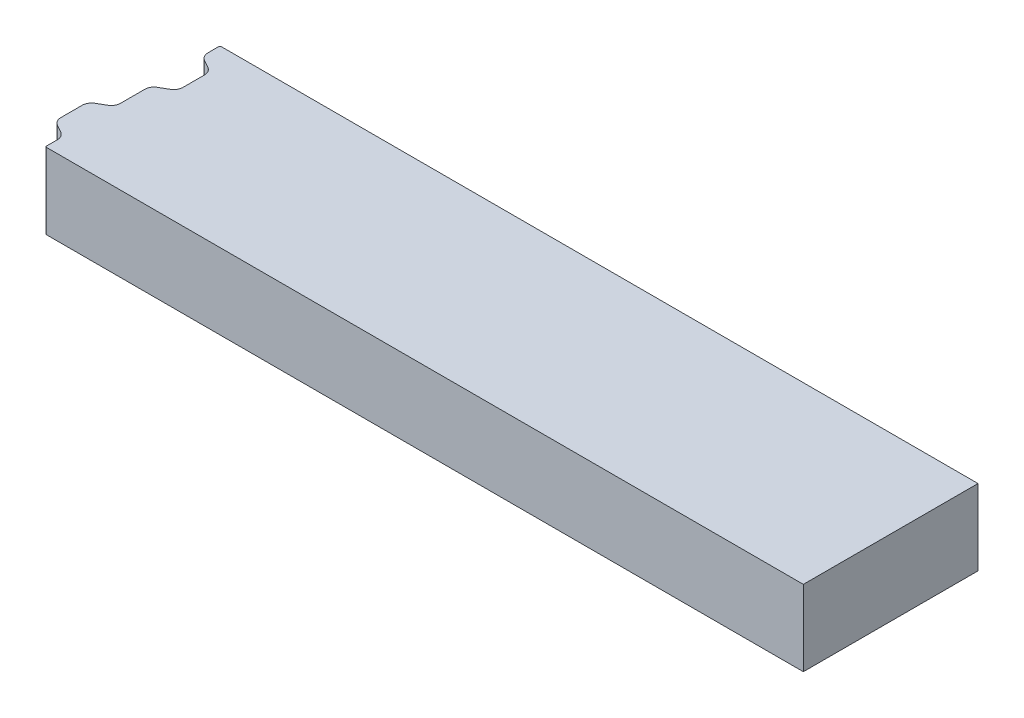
ISO-10303-21;
HEADER;
FILE_DESCRIPTION(('STEP AP214'),'2;1');
FILE_NAME('part.step','',(''),(''),'','','');
FILE_SCHEMA(('AUTOMOTIVE_DESIGN { 1 0 10303 214 1 1 1 1 }'));
ENDSEC;
DATA;
#1=APPLICATION_CONTEXT('core data for automotive mechanical design processes');
#2=APPLICATION_PROTOCOL_DEFINITION('international standard','automotive_design',2000,#1);
#3=PRODUCT_CONTEXT('',#1,'mechanical');
#4=PRODUCT('Part','Part','',(#3));
#5=PRODUCT_RELATED_PRODUCT_CATEGORY('part','',(#4));
#6=PRODUCT_DEFINITION_FORMATION('','',#4);
#7=PRODUCT_DEFINITION_CONTEXT('part definition',#1,'design');
#8=PRODUCT_DEFINITION('design','',#6,#7);
#9=PRODUCT_DEFINITION_SHAPE('','',#8);
#10=(LENGTH_UNIT() NAMED_UNIT(*) SI_UNIT(.MILLI.,.METRE.));
#11=(NAMED_UNIT(*) PLANE_ANGLE_UNIT() SI_UNIT($,.RADIAN.));
#12=(NAMED_UNIT(*) SI_UNIT($,.STERADIAN.) SOLID_ANGLE_UNIT());
#13=UNCERTAINTY_MEASURE_WITH_UNIT(LENGTH_MEASURE(1.E-05),#10,'distance_accuracy_value','');
#14=(GEOMETRIC_REPRESENTATION_CONTEXT(3) GLOBAL_UNCERTAINTY_ASSIGNED_CONTEXT((#13)) GLOBAL_UNIT_ASSIGNED_CONTEXT((#10,
#11,#12)) REPRESENTATION_CONTEXT('',''));
#15=CARTESIAN_POINT('',(0.,0.,0.));
#16=DIRECTION('',(0.,0.,1.));
#17=DIRECTION('',(1.,0.,0.));
#18=AXIS2_PLACEMENT_3D('',#15,#16,#17);
#19=CARTESIAN_POINT('',(-1.59999999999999,13.,-2.07623956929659));
#20=DIRECTION('',(0.,-1.,0.));
#21=DIRECTION('',(0.,0.,-1.));
#22=AXIS2_PLACEMENT_3D('',#19,#20,#21);
#23=CYLINDRICAL_SURFACE('',#22,1.59999999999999);
#24=CARTESIAN_POINT('',(-1.59999999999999,0.,-2.07623956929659));
#25=DIRECTION('',(0.,-1.,0.));
#26=DIRECTION('',(0.,0.,1.));
#27=AXIS2_PLACEMENT_3D('',#24,#25,#26);
#28=CIRCLE('',#27,1.59999999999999);
#29=CARTESIAN_POINT('',(-0.800000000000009,0.,-3.4618802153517));
#30=VERTEX_POINT('',#29);
#31=CARTESIAN_POINT('',(0.,0.,-2.07623956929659));
#32=VERTEX_POINT('',#31);
#33=EDGE_CURVE('E178',#30,#32,#28,.T.);
#34=ORIENTED_EDGE('',*,*,#33,.T.);
#35=DIRECTION('',(0.,-1.,0.));
#36=VECTOR('',#35,1.);
#37=CARTESIAN_POINT('',(0.,13.,-2.07623956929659));
#38=LINE('',#37,#36);
#39=CARTESIAN_POINT('',(0.,13.,-2.07623956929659));
#40=VERTEX_POINT('',#39);
#41=EDGE_CURVE('E11',#40,#32,#38,.T.);
#42=ORIENTED_EDGE('',*,*,#41,.F.);
#43=CARTESIAN_POINT('',(-1.59999999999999,13.,-2.07623956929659));
#44=DIRECTION('',(0.,-1.,0.));
#45=DIRECTION('',(0.,0.,1.));
#46=AXIS2_PLACEMENT_3D('',#43,#44,#45);
#47=CIRCLE('',#46,1.59999999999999);
#48=CARTESIAN_POINT('',(-0.800000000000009,13.,-3.4618802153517));
#49=VERTEX_POINT('',#48);
#50=EDGE_CURVE('E233',#49,#40,#47,.T.);
#51=ORIENTED_EDGE('',*,*,#50,.F.);
#52=DIRECTION('',(0.,-1.,0.));
#53=VECTOR('',#52,1.);
#54=CARTESIAN_POINT('',(-0.800000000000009,13.,-3.4618802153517));
#55=LINE('',#54,#53);
#56=EDGE_CURVE('E191',#49,#30,#55,.T.);
#57=ORIENTED_EDGE('',*,*,#56,.T.);
#58=EDGE_LOOP('',(#34,#42,#51,#57));
#59=FACE_BOUND('',#58,.T.);
#60=ADVANCED_FACE('F26',(#59),#23,.F.);
#61=CARTESIAN_POINT('',(0.,13.,-0.200000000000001));
#62=DIRECTION('',(1.,0.,0.));
#63=DIRECTION('',(0.,0.,-1.));
#64=AXIS2_PLACEMENT_3D('',#61,#62,#63);
#65=PLANE('',#64);
#66=DIRECTION('',(0.,0.,1.));
#67=VECTOR('',#66,1.);
#68=CARTESIAN_POINT('',(0.,0.,-0.200000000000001));
#69=LINE('',#68,#67);
#70=CARTESIAN_POINT('',(0.,0.,-0.200000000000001));
#71=VERTEX_POINT('',#70);
#72=EDGE_CURVE('E174',#32,#71,#69,.T.);
#73=ORIENTED_EDGE('',*,*,#72,.T.);
#74=DIRECTION('',(0.,-1.,0.));
#75=VECTOR('',#74,1.);
#76=CARTESIAN_POINT('',(0.,13.,-0.200000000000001));
#77=LINE('',#76,#75);
#78=CARTESIAN_POINT('',(0.,13.,-0.200000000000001));
#79=VERTEX_POINT('',#78);
#80=EDGE_CURVE('E33',#79,#71,#77,.T.);
#81=ORIENTED_EDGE('',*,*,#80,.F.);
#82=DIRECTION('',(0.,0.,1.));
#83=VECTOR('',#82,1.);
#84=CARTESIAN_POINT('',(0.,13.,-0.200000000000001));
#85=LINE('',#84,#83);
#86=EDGE_CURVE('E187',#40,#79,#85,.T.);
#87=ORIENTED_EDGE('',*,*,#86,.F.);
#88=ORIENTED_EDGE('',*,*,#41,.T.);
#89=EDGE_LOOP('',(#73,#81,#87,#88));
#90=FACE_BOUND('',#89,.T.);
#91=ADVANCED_FACE('F186',(#90),#65,.F.);
#92=CARTESIAN_POINT('',(0.199999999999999,13.,-0.2));
#93=DIRECTION('',(0.,-1.,0.));
#94=DIRECTION('',(0.,0.,-1.));
#95=AXIS2_PLACEMENT_3D('',#92,#93,#94);
#96=CYLINDRICAL_SURFACE('',#95,0.200000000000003);
#97=CARTESIAN_POINT('',(0.199999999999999,0.,-0.2));
#98=DIRECTION('',(0.,1.,0.));
#99=DIRECTION('',(0.,0.,1.));
#100=AXIS2_PLACEMENT_3D('',#97,#98,#99);
#101=CIRCLE('',#100,0.200000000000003);
#102=CARTESIAN_POINT('',(0.199999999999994,0.,0.));
#103=VERTEX_POINT('',#102);
#104=EDGE_CURVE('E180',#71,#103,#101,.T.);
#105=ORIENTED_EDGE('',*,*,#104,.T.);
#106=DIRECTION('',(0.,-1.,0.));
#107=VECTOR('',#106,1.);
#108=CARTESIAN_POINT('',(0.199999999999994,13.,0.));
#109=LINE('',#108,#107);
#110=CARTESIAN_POINT('',(0.199999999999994,13.,0.));
#111=VERTEX_POINT('',#110);
#112=EDGE_CURVE('E329',#111,#103,#109,.T.);
#113=ORIENTED_EDGE('',*,*,#112,.F.);
#114=CARTESIAN_POINT('',(0.199999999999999,13.,-0.2));
#115=DIRECTION('',(0.,1.,0.));
#116=DIRECTION('',(0.,0.,1.));
#117=AXIS2_PLACEMENT_3D('',#114,#115,#116);
#118=CIRCLE('',#117,0.200000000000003);
#119=EDGE_CURVE('E236',#79,#111,#118,.T.);
#120=ORIENTED_EDGE('',*,*,#119,.F.);
#121=ORIENTED_EDGE('',*,*,#80,.T.);
#122=EDGE_LOOP('',(#105,#113,#120,#121));
#123=FACE_BOUND('',#122,.T.);
#124=ADVANCED_FACE('F333',(#123),#96,.T.);
#125=CARTESIAN_POINT('',(0.199999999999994,13.,0.));
#126=DIRECTION('',(0.,0.,-1.));
#127=DIRECTION('',(-1.,0.,0.));
#128=AXIS2_PLACEMENT_3D('',#125,#126,#127);
#129=PLANE('',#128);
#130=DIRECTION('',(1.,0.,0.));
#131=VECTOR('',#130,1.);
#132=CARTESIAN_POINT('',(0.199999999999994,0.,0.));
#133=LINE('',#132,#131);
#134=CARTESIAN_POINT('',(130.2,0.,0.));
#135=VERTEX_POINT('',#134);
#136=EDGE_CURVE('E195',#103,#135,#133,.T.);
#137=ORIENTED_EDGE('',*,*,#136,.T.);
#138=DIRECTION('',(0.,-1.,0.));
#139=VECTOR('',#138,1.);
#140=CARTESIAN_POINT('',(130.2,13.,0.));
#141=LINE('',#140,#139);
#142=CARTESIAN_POINT('',(130.2,13.,0.));
#143=VERTEX_POINT('',#142);
#144=EDGE_CURVE('E326',#143,#135,#141,.T.);
#145=ORIENTED_EDGE('',*,*,#144,.F.);
#146=DIRECTION('',(1.,0.,0.));
#147=VECTOR('',#146,1.);
#148=CARTESIAN_POINT('',(0.199999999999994,13.,0.));
#149=LINE('',#148,#147);
#150=EDGE_CURVE('E238',#111,#143,#149,.T.);
#151=ORIENTED_EDGE('',*,*,#150,.F.);
#152=ORIENTED_EDGE('',*,*,#112,.T.);
#153=EDGE_LOOP('',(#137,#145,#151,#152));
#154=FACE_BOUND('',#153,.T.);
#155=ADVANCED_FACE('F341',(#154),#129,.F.);
#156=CARTESIAN_POINT('',(130.2,13.,-30.));
#157=DIRECTION('',(-1.,0.,0.));
#158=DIRECTION('',(0.,0.,1.));
#159=AXIS2_PLACEMENT_3D('',#156,#157,#158);
#160=PLANE('',#159);
#161=DIRECTION('',(0.,0.,-1.));
#162=VECTOR('',#161,1.);
#163=CARTESIAN_POINT('',(130.2,0.,-30.));
#164=LINE('',#163,#162);
#165=CARTESIAN_POINT('',(130.2,0.,-30.));
#166=VERTEX_POINT('',#165);
#167=EDGE_CURVE('E197',#135,#166,#164,.T.);
#168=ORIENTED_EDGE('',*,*,#167,.T.);
#169=DIRECTION('',(0.,-1.,0.));
#170=VECTOR('',#169,1.);
#171=CARTESIAN_POINT('',(130.2,13.,-30.));
#172=LINE('',#171,#170);
#173=CARTESIAN_POINT('',(130.2,13.,-30.));
#174=VERTEX_POINT('',#173);
#175=EDGE_CURVE('E323',#174,#166,#172,.T.);
#176=ORIENTED_EDGE('',*,*,#175,.F.);
#177=DIRECTION('',(0.,0.,-1.));
#178=VECTOR('',#177,1.);
#179=CARTESIAN_POINT('',(130.2,13.,-30.));
#180=LINE('',#179,#178);
#181=EDGE_CURVE('E240',#143,#174,#180,.T.);
#182=ORIENTED_EDGE('',*,*,#181,.F.);
#183=ORIENTED_EDGE('',*,*,#144,.T.);
#184=EDGE_LOOP('',(#168,#176,#182,#183));
#185=FACE_BOUND('',#184,.T.);
#186=ADVANCED_FACE('F344',(#185),#160,.F.);
#187=CARTESIAN_POINT('',(0.199999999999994,13.,-30.));
#188=DIRECTION('',(0.,0.,1.));
#189=DIRECTION('',(1.,0.,0.));
#190=AXIS2_PLACEMENT_3D('',#187,#188,#189);
#191=PLANE('',#190);
#192=DIRECTION('',(-1.,0.,0.));
#193=VECTOR('',#192,1.);
#194=CARTESIAN_POINT('',(0.199999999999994,0.,-30.));
#195=LINE('',#194,#193);
#196=CARTESIAN_POINT('',(0.199999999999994,0.,-30.));
#197=VERTEX_POINT('',#196);
#198=EDGE_CURVE('E199',#166,#197,#195,.T.);
#199=ORIENTED_EDGE('',*,*,#198,.T.);
#200=DIRECTION('',(0.,-1.,0.));
#201=VECTOR('',#200,1.);
#202=CARTESIAN_POINT('',(0.199999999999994,13.,-30.));
#203=LINE('',#202,#201);
#204=CARTESIAN_POINT('',(0.199999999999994,13.,-30.));
#205=VERTEX_POINT('',#204);
#206=EDGE_CURVE('E320',#205,#197,#203,.T.);
#207=ORIENTED_EDGE('',*,*,#206,.F.);
#208=DIRECTION('',(-1.,0.,0.));
#209=VECTOR('',#208,1.);
#210=CARTESIAN_POINT('',(0.199999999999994,13.,-30.));
#211=LINE('',#210,#209);
#212=EDGE_CURVE('E242',#174,#205,#211,.T.);
#213=ORIENTED_EDGE('',*,*,#212,.F.);
#214=ORIENTED_EDGE('',*,*,#175,.T.);
#215=EDGE_LOOP('',(#199,#207,#213,#214));
#216=FACE_BOUND('',#215,.T.);
#217=ADVANCED_FACE('F349',(#216),#191,.F.);
#218=CARTESIAN_POINT('',(0.199999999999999,13.,-29.8));
#219=DIRECTION('',(0.,-1.,0.));
#220=DIRECTION('',(0.,0.,-1.));
#221=AXIS2_PLACEMENT_3D('',#218,#219,#220);
#222=CYLINDRICAL_SURFACE('',#221,0.200000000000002);
#223=CARTESIAN_POINT('',(0.199999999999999,0.,-29.8));
#224=DIRECTION('',(0.,1.,0.));
#225=DIRECTION('',(0.,0.,-1.));
#226=AXIS2_PLACEMENT_3D('',#223,#224,#225);
#227=CIRCLE('',#226,0.200000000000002);
#228=CARTESIAN_POINT('',(0.,0.,-29.8));
#229=VERTEX_POINT('',#228);
#230=EDGE_CURVE('E201',#197,#229,#227,.T.);
#231=ORIENTED_EDGE('',*,*,#230,.T.);
#232=DIRECTION('',(0.,-1.,0.));
#233=VECTOR('',#232,1.);
#234=CARTESIAN_POINT('',(0.,13.,-29.8));
#235=LINE('',#234,#233);
#236=CARTESIAN_POINT('',(0.,13.,-29.8));
#237=VERTEX_POINT('',#236);
#238=EDGE_CURVE('E317',#237,#229,#235,.T.);
#239=ORIENTED_EDGE('',*,*,#238,.F.);
#240=CARTESIAN_POINT('',(0.199999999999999,13.,-29.8));
#241=DIRECTION('',(0.,1.,0.));
#242=DIRECTION('',(0.,0.,-1.));
#243=AXIS2_PLACEMENT_3D('',#240,#241,#242);
#244=CIRCLE('',#243,0.200000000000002);
#245=EDGE_CURVE('E244',#205,#237,#244,.T.);
#246=ORIENTED_EDGE('',*,*,#245,.F.);
#247=ORIENTED_EDGE('',*,*,#206,.T.);
#248=EDGE_LOOP('',(#231,#239,#246,#247));
#249=FACE_BOUND('',#248,.T.);
#250=ADVANCED_FACE('F355',(#249),#222,.T.);
#251=CARTESIAN_POINT('',(0.,13.,-29.8));
#252=DIRECTION('',(1.,0.,0.));
#253=DIRECTION('',(0.,0.,-1.));
#254=AXIS2_PLACEMENT_3D('',#251,#252,#253);
#255=PLANE('',#254);
#256=DIRECTION('',(0.,0.,1.));
#257=VECTOR('',#256,1.);
#258=CARTESIAN_POINT('',(0.,0.,-29.8));
#259=LINE('',#258,#257);
#260=CARTESIAN_POINT('',(0.,0.,-27.9237604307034));
#261=VERTEX_POINT('',#260);
#262=EDGE_CURVE('E203',#229,#261,#259,.T.);
#263=ORIENTED_EDGE('',*,*,#262,.T.);
#264=DIRECTION('',(0.,-1.,0.));
#265=VECTOR('',#264,1.);
#266=CARTESIAN_POINT('',(0.,13.,-27.9237604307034));
#267=LINE('',#266,#265);
#268=CARTESIAN_POINT('',(0.,13.,-27.9237604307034));
#269=VERTEX_POINT('',#268);
#270=EDGE_CURVE('E314',#269,#261,#267,.T.);
#271=ORIENTED_EDGE('',*,*,#270,.F.);
#272=DIRECTION('',(0.,0.,1.));
#273=VECTOR('',#272,1.);
#274=CARTESIAN_POINT('',(0.,13.,-29.8));
#275=LINE('',#274,#273);
#276=EDGE_CURVE('E246',#237,#269,#275,.T.);
#277=ORIENTED_EDGE('',*,*,#276,.F.);
#278=ORIENTED_EDGE('',*,*,#238,.T.);
#279=EDGE_LOOP('',(#263,#271,#277,#278));
#280=FACE_BOUND('',#279,.T.);
#281=ADVANCED_FACE('F359',(#280),#255,.F.);
#282=CARTESIAN_POINT('',(1.6,13.,-27.9237604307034));
#283=DIRECTION('',(0.,-1.,0.));
#284=DIRECTION('',(0.,0.,-1.));
#285=AXIS2_PLACEMENT_3D('',#282,#283,#284);
#286=CYLINDRICAL_SURFACE('',#285,1.60000000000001);
#287=CARTESIAN_POINT('',(1.6,0.,-27.9237604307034));
#288=DIRECTION('',(0.,1.,0.));
#289=DIRECTION('',(0.,0.,1.));
#290=AXIS2_PLACEMENT_3D('',#287,#288,#289);
#291=CIRCLE('',#290,1.60000000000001);
#292=CARTESIAN_POINT('',(0.800000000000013,0.,-26.5381197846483));
#293=VERTEX_POINT('',#292);
#294=EDGE_CURVE('E205',#261,#293,#291,.T.);
#295=ORIENTED_EDGE('',*,*,#294,.T.);
#296=DIRECTION('',(0.,-1.,0.));
#297=VECTOR('',#296,1.);
#298=CARTESIAN_POINT('',(0.800000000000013,13.,-26.5381197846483));
#299=LINE('',#298,#297);
#300=CARTESIAN_POINT('',(0.800000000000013,13.,-26.5381197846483));
#301=VERTEX_POINT('',#300);
#302=EDGE_CURVE('E311',#301,#293,#299,.T.);
#303=ORIENTED_EDGE('',*,*,#302,.F.);
#304=CARTESIAN_POINT('',(1.6,13.,-27.9237604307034));
#305=DIRECTION('',(0.,1.,0.));
#306=DIRECTION('',(0.,0.,1.));
#307=AXIS2_PLACEMENT_3D('',#304,#305,#306);
#308=CIRCLE('',#307,1.60000000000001);
#309=EDGE_CURVE('E248',#269,#301,#308,.T.);
#310=ORIENTED_EDGE('',*,*,#309,.F.);
#311=ORIENTED_EDGE('',*,*,#270,.T.);
#312=EDGE_LOOP('',(#295,#303,#310,#311));
#313=FACE_BOUND('',#312,.T.);
#314=ADVANCED_FACE('F364',(#313),#286,.T.);
#315=CARTESIAN_POINT('',(0.800000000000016,13.,-26.5381197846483));
#316=DIRECTION('',(0.499999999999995,0.,-0.866025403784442));
#317=DIRECTION('',(-0.866025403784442,0.,-0.499999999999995));
#318=AXIS2_PLACEMENT_3D('',#315,#316,#317);
#319=PLANE('',#318);
#320=DIRECTION('',(0.866025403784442,0.,0.499999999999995));
#321=VECTOR('',#320,1.);
#322=CARTESIAN_POINT('',(0.800000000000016,0.,-26.5381197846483));
#323=LINE('',#322,#321);
#324=CARTESIAN_POINT('',(2.19999999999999,0.,-25.7298294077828));
#325=VERTEX_POINT('',#324);
#326=EDGE_CURVE('E207',#293,#325,#323,.T.);
#327=ORIENTED_EDGE('',*,*,#326,.T.);
#328=DIRECTION('',(0.,-1.,0.));
#329=VECTOR('',#328,1.);
#330=CARTESIAN_POINT('',(2.19999999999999,13.,-25.7298294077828));
#331=LINE('',#330,#329);
#332=CARTESIAN_POINT('',(2.19999999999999,13.,-25.7298294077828));
#333=VERTEX_POINT('',#332);
#334=EDGE_CURVE('E308',#333,#325,#331,.T.);
#335=ORIENTED_EDGE('',*,*,#334,.F.);
#336=DIRECTION('',(0.866025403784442,0.,0.499999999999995));
#337=VECTOR('',#336,1.);
#338=CARTESIAN_POINT('',(0.800000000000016,13.,-26.5381197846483));
#339=LINE('',#338,#337);
#340=EDGE_CURVE('E250',#301,#333,#339,.T.);
#341=ORIENTED_EDGE('',*,*,#340,.F.);
#342=ORIENTED_EDGE('',*,*,#302,.T.);
#343=EDGE_LOOP('',(#327,#335,#341,#342));
#344=FACE_BOUND('',#343,.T.);
#345=ADVANCED_FACE('F370',(#344),#319,.F.);
#346=CARTESIAN_POINT('',(1.40000000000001,13.,-24.3441887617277));
#347=DIRECTION('',(0.,-1.,0.));
#348=DIRECTION('',(0.,0.,-1.));
#349=AXIS2_PLACEMENT_3D('',#346,#347,#348);
#350=CYLINDRICAL_SURFACE('',#349,1.6);
#351=CARTESIAN_POINT('',(1.40000000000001,0.,-24.3441887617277));
#352=DIRECTION('',(0.,-1.,0.));
#353=DIRECTION('',(0.,0.,-1.));
#354=AXIS2_PLACEMENT_3D('',#351,#352,#353);
#355=CIRCLE('',#354,1.6);
#356=CARTESIAN_POINT('',(3.,0.,-24.3441887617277));
#357=VERTEX_POINT('',#356);
#358=EDGE_CURVE('E209',#325,#357,#355,.T.);
#359=ORIENTED_EDGE('',*,*,#358,.T.);
#360=DIRECTION('',(0.,-1.,0.));
#361=VECTOR('',#360,1.);
#362=CARTESIAN_POINT('',(3.,13.,-24.3441887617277));
#363=LINE('',#362,#361);
#364=CARTESIAN_POINT('',(3.,13.,-24.3441887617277));
#365=VERTEX_POINT('',#364);
#366=EDGE_CURVE('E305',#365,#357,#363,.T.);
#367=ORIENTED_EDGE('',*,*,#366,.F.);
#368=CARTESIAN_POINT('',(1.40000000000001,13.,-24.3441887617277));
#369=DIRECTION('',(0.,-1.,0.));
#370=DIRECTION('',(0.,0.,-1.));
#371=AXIS2_PLACEMENT_3D('',#368,#369,#370);
#372=CIRCLE('',#371,1.6);
#373=EDGE_CURVE('E252',#333,#365,#372,.T.);
#374=ORIENTED_EDGE('',*,*,#373,.F.);
#375=ORIENTED_EDGE('',*,*,#334,.T.);
#376=EDGE_LOOP('',(#359,#367,#374,#375));
#377=FACE_BOUND('',#376,.T.);
#378=ADVANCED_FACE('F374',(#377),#350,.F.);
#379=CARTESIAN_POINT('',(3.,13.,-24.3441887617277));
#380=DIRECTION('',(1.,0.,0.));
#381=DIRECTION('',(0.,0.,-1.));
#382=AXIS2_PLACEMENT_3D('',#379,#380,#381);
#383=PLANE('',#382);
#384=DIRECTION('',(0.,0.,1.));
#385=VECTOR('',#384,1.);
#386=CARTESIAN_POINT('',(3.,0.,-24.3441887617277));
#387=LINE('',#386,#385);
#388=CARTESIAN_POINT('',(3.00000000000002,0.,-20.6603785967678));
#389=VERTEX_POINT('',#388);
#390=EDGE_CURVE('E211',#357,#389,#387,.T.);
#391=ORIENTED_EDGE('',*,*,#390,.T.);
#392=DIRECTION('',(0.,-1.,0.));
#393=VECTOR('',#392,1.);
#394=CARTESIAN_POINT('',(3.00000000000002,13.,-20.6603785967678));
#395=LINE('',#394,#393);
#396=CARTESIAN_POINT('',(3.00000000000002,13.,-20.6603785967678));
#397=VERTEX_POINT('',#396);
#398=EDGE_CURVE('E302',#397,#389,#395,.T.);
#399=ORIENTED_EDGE('',*,*,#398,.F.);
#400=DIRECTION('',(0.,0.,1.));
#401=VECTOR('',#400,1.);
#402=CARTESIAN_POINT('',(3.,13.,-24.3441887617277));
#403=LINE('',#402,#401);
#404=EDGE_CURVE('E254',#365,#397,#403,.T.);
#405=ORIENTED_EDGE('',*,*,#404,.F.);
#406=ORIENTED_EDGE('',*,*,#366,.T.);
#407=EDGE_LOOP('',(#391,#399,#405,#406));
#408=FACE_BOUND('',#407,.T.);
#409=ADVANCED_FACE('F379',(#408),#383,.F.);
#410=CARTESIAN_POINT('',(1.40000000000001,13.,-20.6603785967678));
#411=DIRECTION('',(0.,-1.,0.));
#412=DIRECTION('',(0.,0.,-1.));
#413=AXIS2_PLACEMENT_3D('',#410,#411,#412);
#414=CYLINDRICAL_SURFACE('',#413,1.6);
#415=CARTESIAN_POINT('',(1.40000000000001,0.,-20.6603785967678));
#416=DIRECTION('',(0.,-1.,0.));
#417=DIRECTION('',(0.,0.,-1.));
#418=AXIS2_PLACEMENT_3D('',#415,#416,#417);
#419=CIRCLE('',#418,1.6);
#420=CARTESIAN_POINT('',(2.20215355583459,0.,-19.2759835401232));
#421=VERTEX_POINT('',#420);
#422=EDGE_CURVE('E213',#389,#421,#419,.T.);
#423=ORIENTED_EDGE('',*,*,#422,.T.);
#424=DIRECTION('',(0.,-1.,0.));
#425=VECTOR('',#424,1.);
#426=CARTESIAN_POINT('',(2.20215355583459,13.,-19.2759835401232));
#427=LINE('',#426,#425);
#428=CARTESIAN_POINT('',(2.20215355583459,13.,-19.2759835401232));
#429=VERTEX_POINT('',#428);
#430=EDGE_CURVE('E299',#429,#421,#427,.T.);
#431=ORIENTED_EDGE('',*,*,#430,.F.);
#432=CARTESIAN_POINT('',(1.40000000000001,13.,-20.6603785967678));
#433=DIRECTION('',(0.,-1.,0.));
#434=DIRECTION('',(0.,0.,-1.));
#435=AXIS2_PLACEMENT_3D('',#432,#433,#434);
#436=CIRCLE('',#435,1.6);
#437=EDGE_CURVE('E256',#397,#429,#436,.T.);
#438=ORIENTED_EDGE('',*,*,#437,.F.);
#439=ORIENTED_EDGE('',*,*,#398,.T.);
#440=EDGE_LOOP('',(#423,#431,#438,#439));
#441=FACE_BOUND('',#440,.T.);
#442=ADVANCED_FACE('F385',(#441),#414,.F.);
#443=CARTESIAN_POINT('',(2.20215355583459,13.,-19.2759835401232));
#444=DIRECTION('',(0.501345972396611,0.,0.865246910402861));
#445=DIRECTION('',(0.865246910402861,0.,-0.501345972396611));
#446=AXIS2_PLACEMENT_3D('',#443,#444,#445);
#447=PLANE('',#446);
#448=DIRECTION('',(-0.865246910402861,0.,0.501345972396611));
#449=VECTOR('',#448,1.);
#450=CARTESIAN_POINT('',(2.20215355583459,0.,-19.2759835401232));
#451=LINE('',#450,#449);
#452=CARTESIAN_POINT('',(0.797846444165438,0.,-18.4622924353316));
#453=VERTEX_POINT('',#452);
#454=EDGE_CURVE('E215',#421,#453,#451,.T.);
#455=ORIENTED_EDGE('',*,*,#454,.T.);
#456=DIRECTION('',(0.,-1.,0.));
#457=VECTOR('',#456,1.);
#458=CARTESIAN_POINT('',(0.797846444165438,13.,-18.4622924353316));
#459=LINE('',#458,#457);
#460=CARTESIAN_POINT('',(0.797846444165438,13.,-18.4622924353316));
#461=VERTEX_POINT('',#460);
#462=EDGE_CURVE('E296',#461,#453,#459,.T.);
#463=ORIENTED_EDGE('',*,*,#462,.F.);
#464=DIRECTION('',(-0.865246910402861,0.,0.501345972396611));
#465=VECTOR('',#464,1.);
#466=CARTESIAN_POINT('',(2.20215355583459,13.,-19.2759835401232));
#467=LINE('',#466,#465);
#468=EDGE_CURVE('E258',#429,#461,#467,.T.);
#469=ORIENTED_EDGE('',*,*,#468,.F.);
#470=ORIENTED_EDGE('',*,*,#430,.T.);
#471=EDGE_LOOP('',(#455,#463,#469,#470));
#472=FACE_BOUND('',#471,.T.);
#473=ADVANCED_FACE('F389',(#472),#447,.F.);
#474=CARTESIAN_POINT('',(1.6,13.,-17.077897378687));
#475=DIRECTION('',(0.,-1.,0.));
#476=DIRECTION('',(0.,0.,-1.));
#477=AXIS2_PLACEMENT_3D('',#474,#475,#476);
#478=CYLINDRICAL_SURFACE('',#477,1.6);
#479=CARTESIAN_POINT('',(1.6,0.,-17.077897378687));
#480=DIRECTION('',(0.,1.,0.));
#481=DIRECTION('',(0.,0.,1.));
#482=AXIS2_PLACEMENT_3D('',#479,#480,#481);
#483=CIRCLE('',#482,1.6);
#484=CARTESIAN_POINT('',(0.,0.,-17.077897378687));
#485=VERTEX_POINT('',#484);
#486=EDGE_CURVE('E217',#453,#485,#483,.T.);
#487=ORIENTED_EDGE('',*,*,#486,.T.);
#488=DIRECTION('',(0.,-1.,0.));
#489=VECTOR('',#488,1.);
#490=CARTESIAN_POINT('',(0.,13.,-17.077897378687));
#491=LINE('',#490,#489);
#492=CARTESIAN_POINT('',(0.,13.,-17.077897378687));
#493=VERTEX_POINT('',#492);
#494=EDGE_CURVE('E293',#493,#485,#491,.T.);
#495=ORIENTED_EDGE('',*,*,#494,.F.);
#496=CARTESIAN_POINT('',(1.6,13.,-17.077897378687));
#497=DIRECTION('',(0.,1.,0.));
#498=DIRECTION('',(0.,0.,1.));
#499=AXIS2_PLACEMENT_3D('',#496,#497,#498);
#500=CIRCLE('',#499,1.6);
#501=EDGE_CURVE('E260',#461,#493,#500,.T.);
#502=ORIENTED_EDGE('',*,*,#501,.F.);
#503=ORIENTED_EDGE('',*,*,#462,.T.);
#504=EDGE_LOOP('',(#487,#495,#502,#503));
#505=FACE_BOUND('',#504,.T.);
#506=ADVANCED_FACE('F394',(#505),#478,.T.);
#507=CARTESIAN_POINT('',(0.,13.,-17.077897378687));
#508=DIRECTION('',(1.,0.,0.));
#509=DIRECTION('',(0.,0.,-1.));
#510=AXIS2_PLACEMENT_3D('',#507,#508,#509);
#511=PLANE('',#510);
#512=DIRECTION('',(0.,0.,1.));
#513=VECTOR('',#512,1.);
#514=CARTESIAN_POINT('',(0.,0.,-17.077897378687));
#515=LINE('',#514,#513);
#516=CARTESIAN_POINT('',(0.,0.,-12.922102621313));
#517=VERTEX_POINT('',#516);
#518=EDGE_CURVE('E219',#485,#517,#515,.T.);
#519=ORIENTED_EDGE('',*,*,#518,.T.);
#520=DIRECTION('',(0.,-1.,0.));
#521=VECTOR('',#520,1.);
#522=CARTESIAN_POINT('',(0.,13.,-12.922102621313));
#523=LINE('',#522,#521);
#524=CARTESIAN_POINT('',(0.,13.,-12.922102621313));
#525=VERTEX_POINT('',#524);
#526=EDGE_CURVE('E290',#525,#517,#523,.T.);
#527=ORIENTED_EDGE('',*,*,#526,.F.);
#528=DIRECTION('',(0.,0.,1.));
#529=VECTOR('',#528,1.);
#530=CARTESIAN_POINT('',(0.,13.,-17.077897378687));
#531=LINE('',#530,#529);
#532=EDGE_CURVE('E262',#493,#525,#531,.T.);
#533=ORIENTED_EDGE('',*,*,#532,.F.);
#534=ORIENTED_EDGE('',*,*,#494,.T.);
#535=EDGE_LOOP('',(#519,#527,#533,#534));
#536=FACE_BOUND('',#535,.T.);
#537=ADVANCED_FACE('F400',(#536),#511,.F.);
#538=CARTESIAN_POINT('',(-1.6,13.,-12.922102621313));
#539=DIRECTION('',(0.,-1.,0.));
#540=DIRECTION('',(0.,0.,-1.));
#541=AXIS2_PLACEMENT_3D('',#538,#539,#540);
#542=CYLINDRICAL_SURFACE('',#541,1.6);
#543=CARTESIAN_POINT('',(-1.6,0.,-12.922102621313));
#544=DIRECTION('',(0.,-1.,0.));
#545=DIRECTION('',(0.,0.,1.));
#546=AXIS2_PLACEMENT_3D('',#543,#544,#545);
#547=CIRCLE('',#546,1.6);
#548=CARTESIAN_POINT('',(-0.797846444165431,0.,-11.5377075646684));
#549=VERTEX_POINT('',#548);
#550=EDGE_CURVE('E221',#517,#549,#547,.T.);
#551=ORIENTED_EDGE('',*,*,#550,.T.);
#552=DIRECTION('',(0.,-1.,0.));
#553=VECTOR('',#552,1.);
#554=CARTESIAN_POINT('',(-0.797846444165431,13.,-11.5377075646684));
#555=LINE('',#554,#553);
#556=CARTESIAN_POINT('',(-0.797846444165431,13.,-11.5377075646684));
#557=VERTEX_POINT('',#556);
#558=EDGE_CURVE('E287',#557,#549,#555,.T.);
#559=ORIENTED_EDGE('',*,*,#558,.F.);
#560=CARTESIAN_POINT('',(-1.6,13.,-12.922102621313));
#561=DIRECTION('',(0.,-1.,0.));
#562=DIRECTION('',(0.,0.,1.));
#563=AXIS2_PLACEMENT_3D('',#560,#561,#562);
#564=CIRCLE('',#563,1.6);
#565=EDGE_CURVE('E264',#525,#557,#564,.T.);
#566=ORIENTED_EDGE('',*,*,#565,.F.);
#567=ORIENTED_EDGE('',*,*,#526,.T.);
#568=EDGE_LOOP('',(#551,#559,#566,#567));
#569=FACE_BOUND('',#568,.T.);
#570=ADVANCED_FACE('F404',(#569),#542,.F.);
#571=CARTESIAN_POINT('',(-2.20215355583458,13.,-10.7240164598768));
#572=DIRECTION('',(0.50134597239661,0.,0.865246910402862));
#573=DIRECTION('',(0.865246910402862,0.,-0.50134597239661));
#574=AXIS2_PLACEMENT_3D('',#571,#572,#573);
#575=PLANE('',#574);
#576=DIRECTION('',(-0.865246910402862,0.,0.50134597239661));
#577=VECTOR('',#576,1.);
#578=CARTESIAN_POINT('',(-2.20215355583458,0.,-10.7240164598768));
#579=LINE('',#578,#577);
#580=CARTESIAN_POINT('',(-2.20215355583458,0.,-10.7240164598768));
#581=VERTEX_POINT('',#580);
#582=EDGE_CURVE('E223',#549,#581,#579,.T.);
#583=ORIENTED_EDGE('',*,*,#582,.T.);
#584=DIRECTION('',(0.,-1.,0.));
#585=VECTOR('',#584,1.);
#586=CARTESIAN_POINT('',(-2.20215355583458,13.,-10.7240164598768));
#587=LINE('',#586,#585);
#588=CARTESIAN_POINT('',(-2.20215355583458,13.,-10.7240164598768));
#589=VERTEX_POINT('',#588);
#590=EDGE_CURVE('E284',#589,#581,#587,.T.);
#591=ORIENTED_EDGE('',*,*,#590,.F.);
#592=DIRECTION('',(-0.865246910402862,0.,0.50134597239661));
#593=VECTOR('',#592,1.);
#594=CARTESIAN_POINT('',(-2.20215355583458,13.,-10.7240164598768));
#595=LINE('',#594,#593);
#596=EDGE_CURVE('E266',#557,#589,#595,.T.);
#597=ORIENTED_EDGE('',*,*,#596,.F.);
#598=ORIENTED_EDGE('',*,*,#558,.T.);
#599=EDGE_LOOP('',(#583,#591,#597,#598));
#600=FACE_BOUND('',#599,.T.);
#601=ADVANCED_FACE('F409',(#600),#575,.F.);
#602=CARTESIAN_POINT('',(-1.40000000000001,13.,-9.33962140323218));
#603=DIRECTION('',(0.,-1.,0.));
#604=DIRECTION('',(0.,0.,-1.));
#605=AXIS2_PLACEMENT_3D('',#602,#603,#604);
#606=CYLINDRICAL_SURFACE('',#605,1.6);
#607=CARTESIAN_POINT('',(-1.40000000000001,0.,-9.33962140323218));
#608=DIRECTION('',(0.,1.,0.));
#609=DIRECTION('',(0.,0.,-1.));
#610=AXIS2_PLACEMENT_3D('',#607,#608,#609);
#611=CIRCLE('',#610,1.6);
#612=CARTESIAN_POINT('',(-3.00000000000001,0.,-9.33962140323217));
#613=VERTEX_POINT('',#612);
#614=EDGE_CURVE('E225',#581,#613,#611,.T.);
#615=ORIENTED_EDGE('',*,*,#614,.T.);
#616=DIRECTION('',(0.,-1.,0.));
#617=VECTOR('',#616,1.);
#618=CARTESIAN_POINT('',(-3.00000000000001,13.,-9.33962140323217));
#619=LINE('',#618,#617);
#620=CARTESIAN_POINT('',(-3.00000000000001,13.,-9.33962140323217));
#621=VERTEX_POINT('',#620);
#622=EDGE_CURVE('E281',#621,#613,#619,.T.);
#623=ORIENTED_EDGE('',*,*,#622,.F.);
#624=CARTESIAN_POINT('',(-1.40000000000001,13.,-9.33962140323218));
#625=DIRECTION('',(0.,1.,0.));
#626=DIRECTION('',(0.,0.,-1.));
#627=AXIS2_PLACEMENT_3D('',#624,#625,#626);
#628=CIRCLE('',#627,1.6);
#629=EDGE_CURVE('E268',#589,#621,#628,.T.);
#630=ORIENTED_EDGE('',*,*,#629,.F.);
#631=ORIENTED_EDGE('',*,*,#590,.T.);
#632=EDGE_LOOP('',(#615,#623,#630,#631));
#633=FACE_BOUND('',#632,.T.);
#634=ADVANCED_FACE('F415',(#633),#606,.T.);
#635=CARTESIAN_POINT('',(-2.99999999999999,13.,-5.65581123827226));
#636=DIRECTION('',(1.,0.,0.));
#637=DIRECTION('',(0.,0.,-1.));
#638=AXIS2_PLACEMENT_3D('',#635,#636,#637);
#639=PLANE('',#638);
#640=DIRECTION('',(0.,0.,1.));
#641=VECTOR('',#640,1.);
#642=CARTESIAN_POINT('',(-2.99999999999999,0.,-5.65581123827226));
#643=LINE('',#642,#641);
#644=CARTESIAN_POINT('',(-2.99999999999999,0.,-5.65581123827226));
#645=VERTEX_POINT('',#644);
#646=EDGE_CURVE('E227',#613,#645,#643,.T.);
#647=ORIENTED_EDGE('',*,*,#646,.T.);
#648=DIRECTION('',(0.,-1.,0.));
#649=VECTOR('',#648,1.);
#650=CARTESIAN_POINT('',(-2.99999999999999,13.,-5.65581123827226));
#651=LINE('',#650,#649);
#652=CARTESIAN_POINT('',(-2.99999999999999,13.,-5.65581123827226));
#653=VERTEX_POINT('',#652);
#654=EDGE_CURVE('E278',#653,#645,#651,.T.);
#655=ORIENTED_EDGE('',*,*,#654,.F.);
#656=DIRECTION('',(0.,0.,1.));
#657=VECTOR('',#656,1.);
#658=CARTESIAN_POINT('',(-2.99999999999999,13.,-5.65581123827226));
#659=LINE('',#658,#657);
#660=EDGE_CURVE('E270',#621,#653,#659,.T.);
#661=ORIENTED_EDGE('',*,*,#660,.F.);
#662=ORIENTED_EDGE('',*,*,#622,.T.);
#663=EDGE_LOOP('',(#647,#655,#661,#662));
#664=FACE_BOUND('',#663,.T.);
#665=ADVANCED_FACE('F419',(#664),#639,.F.);
#666=CARTESIAN_POINT('',(-1.4,13.,-5.65581123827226));
#667=DIRECTION('',(0.,-1.,0.));
#668=DIRECTION('',(0.,0.,-1.));
#669=AXIS2_PLACEMENT_3D('',#666,#667,#668);
#670=CYLINDRICAL_SURFACE('',#669,1.59999999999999);
#671=CARTESIAN_POINT('',(-1.4,0.,-5.65581123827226));
#672=DIRECTION('',(0.,1.,0.));
#673=DIRECTION('',(0.,0.,-1.));
#674=AXIS2_PLACEMENT_3D('',#671,#672,#673);
#675=CIRCLE('',#674,1.59999999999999);
#676=CARTESIAN_POINT('',(-2.19999999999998,0.,-4.27017059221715));
#677=VERTEX_POINT('',#676);
#678=EDGE_CURVE('E229',#645,#677,#675,.T.);
#679=ORIENTED_EDGE('',*,*,#678,.T.);
#680=DIRECTION('',(0.,-1.,0.));
#681=VECTOR('',#680,1.);
#682=CARTESIAN_POINT('',(-2.19999999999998,13.,-4.27017059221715));
#683=LINE('',#682,#681);
#684=CARTESIAN_POINT('',(-2.19999999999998,13.,-4.27017059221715));
#685=VERTEX_POINT('',#684);
#686=EDGE_CURVE('E275',#685,#677,#683,.T.);
#687=ORIENTED_EDGE('',*,*,#686,.F.);
#688=CARTESIAN_POINT('',(-1.4,13.,-5.65581123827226));
#689=DIRECTION('',(0.,1.,0.));
#690=DIRECTION('',(0.,0.,-1.));
#691=AXIS2_PLACEMENT_3D('',#688,#689,#690);
#692=CIRCLE('',#691,1.59999999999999);
#693=EDGE_CURVE('E45',#653,#685,#692,.T.);
#694=ORIENTED_EDGE('',*,*,#693,.F.);
#695=ORIENTED_EDGE('',*,*,#654,.T.);
#696=EDGE_LOOP('',(#679,#687,#694,#695));
#697=FACE_BOUND('',#696,.T.);
#698=ADVANCED_FACE('F422',(#697),#670,.T.);
#699=CARTESIAN_POINT('',(-0.800000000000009,13.,-3.4618802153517));
#700=DIRECTION('',(0.499999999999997,0.,-0.866025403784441));
#701=DIRECTION('',(-0.866025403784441,0.,-0.499999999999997));
#702=AXIS2_PLACEMENT_3D('',#699,#700,#701);
#703=PLANE('',#702);
#704=DIRECTION('',(0.866025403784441,0.,0.499999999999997));
#705=VECTOR('',#704,1.);
#706=CARTESIAN_POINT('',(-0.800000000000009,0.,-3.4618802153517));
#707=LINE('',#706,#705);
#708=EDGE_CURVE('E231',#677,#30,#707,.T.);
#709=ORIENTED_EDGE('',*,*,#708,.T.);
#710=ORIENTED_EDGE('',*,*,#56,.F.);
#711=DIRECTION('',(0.866025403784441,0.,0.499999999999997));
#712=VECTOR('',#711,1.);
#713=CARTESIAN_POINT('',(-0.800000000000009,13.,-3.4618802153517));
#714=LINE('',#713,#712);
#715=EDGE_CURVE('E40',#685,#49,#714,.T.);
#716=ORIENTED_EDGE('',*,*,#715,.F.);
#717=ORIENTED_EDGE('',*,*,#686,.T.);
#718=EDGE_LOOP('',(#709,#710,#716,#717));
#719=FACE_BOUND('',#718,.T.);
#720=ADVANCED_FACE('F424',(#719),#703,.F.);
#721=CARTESIAN_POINT('',(-1.59999999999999,13.,-2.07623956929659));
#722=DIRECTION('',(0.,1.,0.));
#723=DIRECTION('',(0.,0.,1.));
#724=AXIS2_PLACEMENT_3D('',#721,#722,#723);
#725=PLANE('',#724);
#726=ORIENTED_EDGE('',*,*,#50,.T.);
#727=ORIENTED_EDGE('',*,*,#86,.T.);
#728=ORIENTED_EDGE('',*,*,#119,.T.);
#729=ORIENTED_EDGE('',*,*,#150,.T.);
#730=ORIENTED_EDGE('',*,*,#181,.T.);
#731=ORIENTED_EDGE('',*,*,#212,.T.);
#732=ORIENTED_EDGE('',*,*,#245,.T.);
#733=ORIENTED_EDGE('',*,*,#276,.T.);
#734=ORIENTED_EDGE('',*,*,#309,.T.);
#735=ORIENTED_EDGE('',*,*,#340,.T.);
#736=ORIENTED_EDGE('',*,*,#373,.T.);
#737=ORIENTED_EDGE('',*,*,#404,.T.);
#738=ORIENTED_EDGE('',*,*,#437,.T.);
#739=ORIENTED_EDGE('',*,*,#468,.T.);
#740=ORIENTED_EDGE('',*,*,#501,.T.);
#741=ORIENTED_EDGE('',*,*,#532,.T.);
#742=ORIENTED_EDGE('',*,*,#565,.T.);
#743=ORIENTED_EDGE('',*,*,#596,.T.);
#744=ORIENTED_EDGE('',*,*,#629,.T.);
#745=ORIENTED_EDGE('',*,*,#660,.T.);
#746=ORIENTED_EDGE('',*,*,#693,.T.);
#747=ORIENTED_EDGE('',*,*,#715,.T.);
#748=EDGE_LOOP('',(#726,#727,#728,#729,#730,#731,#732,#733,#734,#735,#736,#737,#738,#739,#740,
#741,#742,#743,#744,#745,#746,#747));
#749=FACE_BOUND('',#748,.T.);
#750=ADVANCED_FACE('F336',(#749),#725,.T.);
#751=CARTESIAN_POINT('',(-1.59999999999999,0.,-2.07623956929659));
#752=DIRECTION('',(0.,1.,0.));
#753=DIRECTION('',(0.,0.,1.));
#754=AXIS2_PLACEMENT_3D('',#751,#752,#753);
#755=PLANE('',#754);
#756=ORIENTED_EDGE('',*,*,#33,.F.);
#757=ORIENTED_EDGE('',*,*,#708,.F.);
#758=ORIENTED_EDGE('',*,*,#678,.F.);
#759=ORIENTED_EDGE('',*,*,#646,.F.);
#760=ORIENTED_EDGE('',*,*,#614,.F.);
#761=ORIENTED_EDGE('',*,*,#582,.F.);
#762=ORIENTED_EDGE('',*,*,#550,.F.);
#763=ORIENTED_EDGE('',*,*,#518,.F.);
#764=ORIENTED_EDGE('',*,*,#486,.F.);
#765=ORIENTED_EDGE('',*,*,#454,.F.);
#766=ORIENTED_EDGE('',*,*,#422,.F.);
#767=ORIENTED_EDGE('',*,*,#390,.F.);
#768=ORIENTED_EDGE('',*,*,#358,.F.);
#769=ORIENTED_EDGE('',*,*,#326,.F.);
#770=ORIENTED_EDGE('',*,*,#294,.F.);
#771=ORIENTED_EDGE('',*,*,#262,.F.);
#772=ORIENTED_EDGE('',*,*,#230,.F.);
#773=ORIENTED_EDGE('',*,*,#198,.F.);
#774=ORIENTED_EDGE('',*,*,#167,.F.);
#775=ORIENTED_EDGE('',*,*,#136,.F.);
#776=ORIENTED_EDGE('',*,*,#104,.F.);
#777=ORIENTED_EDGE('',*,*,#72,.F.);
#778=EDGE_LOOP('',(#756,#757,#758,#759,#760,#761,#762,#763,#764,#765,#766,#767,#768,#769,#770,
#771,#772,#773,#774,#775,#776,#777));
#779=FACE_BOUND('',#778,.T.);
#780=ADVANCED_FACE('F175',(#779),#755,.F.);
#781=CLOSED_SHELL('',(#60,#91,#124,#155,#186,#217,#250,#281,#314,#345,#378,#409,#442,#473,#506,
#537,#570,#601,#634,#665,#698,#720,#750,#780));
#782=MANIFOLD_SOLID_BREP('B2',#781);
#783=ADVANCED_BREP_SHAPE_REPRESENTATION('',(#18,#782),#14);
#784=SHAPE_DEFINITION_REPRESENTATION(#9,#783);
ENDSEC;
END-ISO-10303-21;
